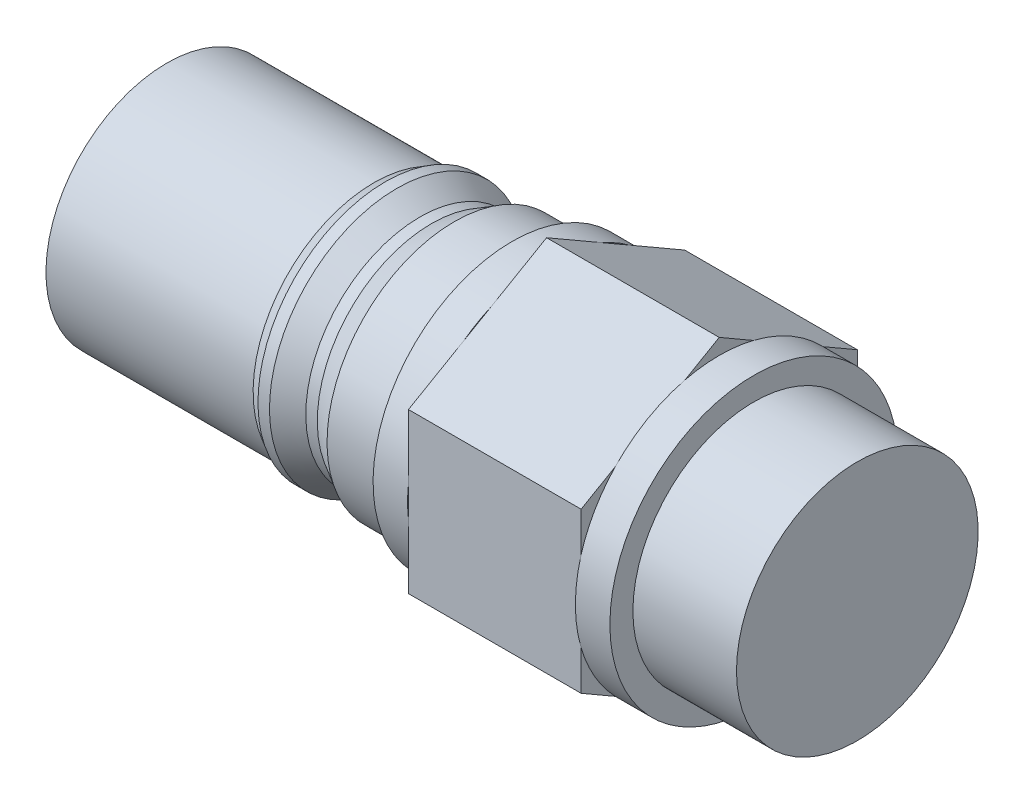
ISO-10303-21;
HEADER;
FILE_DESCRIPTION(('STEP AP214'),'2;1');
FILE_NAME('part.step','',(''),(''),'','','');
FILE_SCHEMA(('AUTOMOTIVE_DESIGN { 1 0 10303 214 1 1 1 1 }'));
ENDSEC;
DATA;
#1=APPLICATION_CONTEXT('core data for automotive mechanical design processes');
#2=APPLICATION_PROTOCOL_DEFINITION('international standard','automotive_design',2000,#1);
#3=PRODUCT_CONTEXT('',#1,'mechanical');
#4=PRODUCT('Part','Part','',(#3));
#5=PRODUCT_RELATED_PRODUCT_CATEGORY('part','',(#4));
#6=PRODUCT_DEFINITION_FORMATION('','',#4);
#7=PRODUCT_DEFINITION_CONTEXT('part definition',#1,'design');
#8=PRODUCT_DEFINITION('design','',#6,#7);
#9=PRODUCT_DEFINITION_SHAPE('','',#8);
#10=(LENGTH_UNIT() NAMED_UNIT(*) SI_UNIT(.MILLI.,.METRE.));
#11=(NAMED_UNIT(*) PLANE_ANGLE_UNIT() SI_UNIT($,.RADIAN.));
#12=(NAMED_UNIT(*) SI_UNIT($,.STERADIAN.) SOLID_ANGLE_UNIT());
#13=UNCERTAINTY_MEASURE_WITH_UNIT(LENGTH_MEASURE(1.E-05),#10,'distance_accuracy_value','');
#14=(GEOMETRIC_REPRESENTATION_CONTEXT(3) GLOBAL_UNCERTAINTY_ASSIGNED_CONTEXT((#13)) GLOBAL_UNIT_ASSIGNED_CONTEXT((#10,
#11,#12)) REPRESENTATION_CONTEXT('',''));
#15=CARTESIAN_POINT('',(0.,0.,0.));
#16=DIRECTION('',(0.,0.,1.));
#17=DIRECTION('',(1.,0.,0.));
#18=AXIS2_PLACEMENT_3D('',#15,#16,#17);
#19=CARTESIAN_POINT('',(48.,0.,0.));
#20=DIRECTION('',(1.,0.,0.));
#21=DIRECTION('',(0.,0.,-1.));
#22=AXIS2_PLACEMENT_3D('',#19,#20,#21);
#23=PLANE('',#22);
#24=DIRECTION('',(0.,-1.,0.));
#25=VECTOR('',#24,1.);
#26=CARTESIAN_POINT('',(48.,6.92820323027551,12.));
#27=LINE('',#26,#25);
#28=CARTESIAN_POINT('',(48.,6.92820323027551,12.));
#29=VERTEX_POINT('',#28);
#30=CARTESIAN_POINT('',(48.,3.5,12.));
#31=VERTEX_POINT('',#30);
#32=EDGE_CURVE('E183',#29,#31,#27,.T.);
#33=ORIENTED_EDGE('',*,*,#32,.T.);
#34=CARTESIAN_POINT('',(48.,0.,0.));
#35=DIRECTION('',(-1.,0.,0.));
#36=DIRECTION('',(0.,0.,1.));
#37=AXIS2_PLACEMENT_3D('',#34,#35,#36);
#38=CIRCLE('',#37,12.5);
#39=CARTESIAN_POINT('',(48.,8.64230484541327,9.03108891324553));
#40=VERTEX_POINT('',#39);
#41=EDGE_CURVE('E166',#31,#40,#38,.T.);
#42=ORIENTED_EDGE('',*,*,#41,.T.);
#43=DIRECTION('',(0.,-0.5,0.866025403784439));
#44=VECTOR('',#43,1.);
#45=CARTESIAN_POINT('',(48.,13.856406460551,0.));
#46=LINE('',#45,#44);
#47=EDGE_CURVE('E187',#40,#29,#46,.T.);
#48=ORIENTED_EDGE('',*,*,#47,.T.);
#49=EDGE_LOOP('',(#33,#42,#48));
#50=FACE_BOUND('',#49,.T.);
#51=ADVANCED_FACE('F33',(#50),#23,.T.);
#52=CARTESIAN_POINT('',(48.,13.856406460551,0.));
#53=VERTEX_POINT('',#52);
#54=CARTESIAN_POINT('',(48.,12.1423048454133,2.96891108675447));
#55=VERTEX_POINT('',#54);
#56=EDGE_CURVE('E194',#53,#55,#46,.T.);
#57=ORIENTED_EDGE('',*,*,#56,.T.);
#58=CARTESIAN_POINT('',(48.,12.1423048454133,-2.96891108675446));
#59=VERTEX_POINT('',#58);
#60=EDGE_CURVE('E11',#55,#59,#38,.T.);
#61=ORIENTED_EDGE('',*,*,#60,.T.);
#62=DIRECTION('',(0.,0.5,0.866025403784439));
#63=VECTOR('',#62,1.);
#64=CARTESIAN_POINT('',(48.,6.92820323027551,-12.));
#65=LINE('',#64,#63);
#66=EDGE_CURVE('E205',#59,#53,#65,.T.);
#67=ORIENTED_EDGE('',*,*,#66,.T.);
#68=EDGE_LOOP('',(#57,#61,#67));
#69=FACE_BOUND('',#68,.T.);
#70=ADVANCED_FACE('F417',(#69),#23,.T.);
#71=CARTESIAN_POINT('',(48.,6.92820323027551,-12.));
#72=VERTEX_POINT('',#71);
#73=CARTESIAN_POINT('',(48.,8.64230484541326,-9.03108891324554));
#74=VERTEX_POINT('',#73);
#75=EDGE_CURVE('E202',#72,#74,#65,.T.);
#76=ORIENTED_EDGE('',*,*,#75,.T.);
#77=CARTESIAN_POINT('',(48.,3.50000000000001,-12.));
#78=VERTEX_POINT('',#77);
#79=EDGE_CURVE('E42',#74,#78,#38,.T.);
#80=ORIENTED_EDGE('',*,*,#79,.T.);
#81=DIRECTION('',(0.,1.,0.));
#82=VECTOR('',#81,1.);
#83=CARTESIAN_POINT('',(48.,-6.92820323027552,-12.));
#84=LINE('',#83,#82);
#85=EDGE_CURVE('E260',#78,#72,#84,.T.);
#86=ORIENTED_EDGE('',*,*,#85,.T.);
#87=EDGE_LOOP('',(#76,#80,#86));
#88=FACE_BOUND('',#87,.T.);
#89=ADVANCED_FACE('F423',(#88),#23,.T.);
#90=CARTESIAN_POINT('',(48.,-6.92820323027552,-12.));
#91=VERTEX_POINT('',#90);
#92=CARTESIAN_POINT('',(48.,-3.50000000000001,-12.));
#93=VERTEX_POINT('',#92);
#94=EDGE_CURVE('E255',#91,#93,#84,.T.);
#95=ORIENTED_EDGE('',*,*,#94,.T.);
#96=CARTESIAN_POINT('',(48.,-8.64230484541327,-9.03108891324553));
#97=VERTEX_POINT('',#96);
#98=EDGE_CURVE('E281',#93,#97,#38,.T.);
#99=ORIENTED_EDGE('',*,*,#98,.T.);
#100=DIRECTION('',(0.,0.5,-0.866025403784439));
#101=VECTOR('',#100,1.);
#102=CARTESIAN_POINT('',(48.,-13.856406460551,0.));
#103=LINE('',#102,#101);
#104=EDGE_CURVE('E264',#97,#91,#103,.T.);
#105=ORIENTED_EDGE('',*,*,#104,.T.);
#106=EDGE_LOOP('',(#95,#99,#105));
#107=FACE_BOUND('',#106,.T.);
#108=ADVANCED_FACE('F300',(#107),#23,.T.);
#109=CARTESIAN_POINT('',(48.,-13.856406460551,0.));
#110=VERTEX_POINT('',#109);
#111=CARTESIAN_POINT('',(48.,-12.1423048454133,-2.96891108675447));
#112=VERTEX_POINT('',#111);
#113=EDGE_CURVE('E261',#110,#112,#103,.T.);
#114=ORIENTED_EDGE('',*,*,#113,.T.);
#115=CARTESIAN_POINT('',(48.,-12.1423048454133,2.96891108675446));
#116=VERTEX_POINT('',#115);
#117=EDGE_CURVE('E274',#112,#116,#38,.T.);
#118=ORIENTED_EDGE('',*,*,#117,.T.);
#119=DIRECTION('',(0.,-0.5,-0.866025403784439));
#120=VECTOR('',#119,1.);
#121=CARTESIAN_POINT('',(48.,-6.92820323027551,12.));
#122=LINE('',#121,#120);
#123=EDGE_CURVE('E189',#116,#110,#122,.T.);
#124=ORIENTED_EDGE('',*,*,#123,.T.);
#125=EDGE_LOOP('',(#114,#118,#124));
#126=FACE_BOUND('',#125,.T.);
#127=ADVANCED_FACE('F278',(#126),#23,.T.);
#128=CARTESIAN_POINT('',(33.,12.0773502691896,0.));
#129=DIRECTION('',(1.,0.,0.));
#130=DIRECTION('',(0.,1.,0.));
#131=AXIS2_PLACEMENT_3D('',#128,#129,#130);
#132=PLANE('',#131);
#133=DIRECTION('',(0.,0.5,0.866025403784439));
#134=VECTOR('',#133,1.);
#135=CARTESIAN_POINT('',(33.,6.92820323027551,-12.));
#136=LINE('',#135,#134);
#137=CARTESIAN_POINT('',(33.,9.70995788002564,-7.18185961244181));
#138=VERTEX_POINT('',#137);
#139=CARTESIAN_POINT('',(33.,11.0746518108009,-4.81814038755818));
#140=VERTEX_POINT('',#139);
#141=EDGE_CURVE('E223',#138,#140,#136,.T.);
#142=ORIENTED_EDGE('',*,*,#141,.F.);
#143=CARTESIAN_POINT('',(33.,0.,0.));
#144=DIRECTION('',(1.,0.,0.));
#145=DIRECTION('',(0.,1.,0.));
#146=AXIS2_PLACEMENT_3D('',#143,#144,#145);
#147=CIRCLE('',#146,12.0773502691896);
#148=EDGE_CURVE('E326',#138,#140,#147,.T.);
#149=ORIENTED_EDGE('',*,*,#148,.T.);
#150=EDGE_LOOP('',(#142,#149));
#151=FACE_BOUND('',#150,.T.);
#152=ADVANCED_FACE('F399',(#151),#132,.T.);
#153=DIRECTION('',(0.,1.,0.));
#154=VECTOR('',#153,1.);
#155=CARTESIAN_POINT('',(33.,-6.92820323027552,-12.));
#156=LINE('',#155,#154);
#157=CARTESIAN_POINT('',(33.,-1.36469393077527,-12.));
#158=VERTEX_POINT('',#157);
#159=CARTESIAN_POINT('',(33.,1.36469393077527,-12.));
#160=VERTEX_POINT('',#159);
#161=EDGE_CURVE('E215',#158,#160,#156,.T.);
#162=ORIENTED_EDGE('',*,*,#161,.F.);
#163=EDGE_CURVE('E388',#158,#160,#147,.T.);
#164=ORIENTED_EDGE('',*,*,#163,.T.);
#165=EDGE_LOOP('',(#162,#164));
#166=FACE_BOUND('',#165,.T.);
#167=ADVANCED_FACE('F443',(#166),#132,.T.);
#168=DIRECTION('',(0.,0.5,-0.866025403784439));
#169=VECTOR('',#168,1.);
#170=CARTESIAN_POINT('',(33.,-13.856406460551,0.));
#171=LINE('',#170,#169);
#172=CARTESIAN_POINT('',(33.,-11.0746518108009,-4.81814038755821));
#173=VERTEX_POINT('',#172);
#174=CARTESIAN_POINT('',(33.,-9.70995788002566,-7.18185961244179));
#175=VERTEX_POINT('',#174);
#176=EDGE_CURVE('E224',#173,#175,#171,.T.);
#177=ORIENTED_EDGE('',*,*,#176,.F.);
#178=EDGE_CURVE('E381',#173,#175,#147,.T.);
#179=ORIENTED_EDGE('',*,*,#178,.T.);
#180=EDGE_LOOP('',(#177,#179));
#181=FACE_BOUND('',#180,.T.);
#182=ADVANCED_FACE('F536',(#181),#132,.T.);
#183=DIRECTION('',(0.,-0.5,-0.866025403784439));
#184=VECTOR('',#183,1.);
#185=CARTESIAN_POINT('',(33.,-6.92820323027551,12.));
#186=LINE('',#185,#184);
#187=CARTESIAN_POINT('',(33.,-9.70995788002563,7.18185961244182));
#188=VERTEX_POINT('',#187);
#189=CARTESIAN_POINT('',(33.,-11.0746518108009,4.81814038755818));
#190=VERTEX_POINT('',#189);
#191=EDGE_CURVE('E230',#188,#190,#186,.T.);
#192=ORIENTED_EDGE('',*,*,#191,.F.);
#193=EDGE_CURVE('E374',#188,#190,#147,.T.);
#194=ORIENTED_EDGE('',*,*,#193,.T.);
#195=EDGE_LOOP('',(#192,#194));
#196=FACE_BOUND('',#195,.T.);
#197=ADVANCED_FACE('F527',(#196),#132,.T.);
#198=DIRECTION('',(0.,-1.,0.));
#199=VECTOR('',#198,1.);
#200=CARTESIAN_POINT('',(33.,6.92820323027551,12.));
#201=LINE('',#200,#199);
#202=CARTESIAN_POINT('',(33.,1.36469393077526,12.));
#203=VERTEX_POINT('',#202);
#204=CARTESIAN_POINT('',(33.,-1.36469393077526,12.));
#205=VERTEX_POINT('',#204);
#206=EDGE_CURVE('E235',#203,#205,#201,.T.);
#207=ORIENTED_EDGE('',*,*,#206,.F.);
#208=EDGE_CURVE('E368',#203,#205,#147,.T.);
#209=ORIENTED_EDGE('',*,*,#208,.T.);
#210=EDGE_LOOP('',(#207,#209));
#211=FACE_BOUND('',#210,.T.);
#212=ADVANCED_FACE('F412',(#211),#132,.T.);
#213=CARTESIAN_POINT('',(0.,0.,0.));
#214=DIRECTION('',(-1.,0.,0.));
#215=DIRECTION('',(0.,-1.,0.));
#216=AXIS2_PLACEMENT_3D('',#213,#214,#215);
#217=PLANE('',#216);
#218=CARTESIAN_POINT('',(0.,0.,0.));
#219=DIRECTION('',(1.,0.,0.));
#220=DIRECTION('',(0.,1.,0.));
#221=AXIS2_PLACEMENT_3D('',#218,#219,#220);
#222=CIRCLE('',#221,10.5);
#223=CARTESIAN_POINT('',(0.,10.5,0.));
#224=VERTEX_POINT('',#223);
#225=EDGE_CURVE('E37',#224,#224,#222,.T.);
#226=ORIENTED_EDGE('',*,*,#225,.F.);
#227=EDGE_LOOP('',(#226));
#228=FACE_BOUND('',#227,.T.);
#229=ADVANCED_FACE('F35',(#228),#217,.T.);
#230=CARTESIAN_POINT('',(33.,0.,0.));
#231=DIRECTION('',(1.,0.,0.));
#232=DIRECTION('',(0.,1.,0.));
#233=AXIS2_PLACEMENT_3D('',#230,#231,#232);
#234=CYLINDRICAL_SURFACE('',#233,10.5);
#235=ORIENTED_EDGE('',*,*,#225,.T.);
#236=EDGE_LOOP('',(#235));
#237=FACE_BOUND('',#236,.T.);
#238=CARTESIAN_POINT('',(18.,0.,0.));
#239=DIRECTION('',(1.,0.,0.));
#240=DIRECTION('',(0.,1.,0.));
#241=AXIS2_PLACEMENT_3D('',#238,#239,#240);
#242=CIRCLE('',#241,10.5);
#243=CARTESIAN_POINT('',(18.,10.5,0.));
#244=VERTEX_POINT('',#243);
#245=EDGE_CURVE('E353',#244,#244,#242,.T.);
#246=ORIENTED_EDGE('',*,*,#245,.F.);
#247=EDGE_LOOP('',(#246));
#248=FACE_BOUND('',#247,.T.);
#249=ADVANCED_FACE('F620',(#237,#248),#234,.T.);
#250=CARTESIAN_POINT('',(19.,0.,0.));
#251=DIRECTION('',(1.,0.,0.));
#252=DIRECTION('',(0.,1.,0.));
#253=AXIS2_PLACEMENT_3D('',#250,#251,#252);
#254=CONICAL_SURFACE('',#253,11.0773502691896,0.5235987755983);
#255=ORIENTED_EDGE('',*,*,#245,.T.);
#256=EDGE_LOOP('',(#255));
#257=FACE_BOUND('',#256,.T.);
#258=CARTESIAN_POINT('',(19.,0.,0.));
#259=DIRECTION('',(1.,0.,0.));
#260=DIRECTION('',(0.,1.,0.));
#261=AXIS2_PLACEMENT_3D('',#258,#259,#260);
#262=CIRCLE('',#261,11.0773502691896);
#263=CARTESIAN_POINT('',(19.,11.0773502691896,0.));
#264=VERTEX_POINT('',#263);
#265=EDGE_CURVE('E351',#264,#264,#262,.T.);
#266=ORIENTED_EDGE('',*,*,#265,.F.);
#267=EDGE_LOOP('',(#266));
#268=FACE_BOUND('',#267,.T.);
#269=ADVANCED_FACE('F610',(#257,#268),#254,.T.);
#270=CARTESIAN_POINT('',(33.,0.,0.));
#271=DIRECTION('',(1.,0.,0.));
#272=DIRECTION('',(0.,1.,0.));
#273=AXIS2_PLACEMENT_3D('',#270,#271,#272);
#274=CYLINDRICAL_SURFACE('',#273,11.0773502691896);
#275=ORIENTED_EDGE('',*,*,#265,.T.);
#276=EDGE_LOOP('',(#275));
#277=FACE_BOUND('',#276,.T.);
#278=CARTESIAN_POINT('',(20.,0.,0.));
#279=DIRECTION('',(1.,0.,0.));
#280=DIRECTION('',(0.,1.,0.));
#281=AXIS2_PLACEMENT_3D('',#278,#279,#280);
#282=CIRCLE('',#281,11.0773502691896);
#283=CARTESIAN_POINT('',(20.,11.0773502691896,0.));
#284=VERTEX_POINT('',#283);
#285=EDGE_CURVE('E348',#284,#284,#282,.T.);
#286=ORIENTED_EDGE('',*,*,#285,.F.);
#287=EDGE_LOOP('',(#286));
#288=FACE_BOUND('',#287,.T.);
#289=ADVANCED_FACE('F599',(#277,#288),#274,.T.);
#290=CARTESIAN_POINT('',(22.,0.,0.));
#291=DIRECTION('',(-1.,0.,0.));
#292=DIRECTION('',(0.,-1.,0.));
#293=AXIS2_PLACEMENT_3D('',#290,#291,#292);
#294=CONICAL_SURFACE('',#293,9.92264973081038,0.523598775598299);
#295=ORIENTED_EDGE('',*,*,#285,.T.);
#296=EDGE_LOOP('',(#295));
#297=FACE_BOUND('',#296,.T.);
#298=CARTESIAN_POINT('',(22.,0.,0.));
#299=DIRECTION('',(1.,0.,0.));
#300=DIRECTION('',(0.,1.,0.));
#301=AXIS2_PLACEMENT_3D('',#298,#299,#300);
#302=CIRCLE('',#301,9.92264973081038);
#303=CARTESIAN_POINT('',(22.,9.92264973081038,0.));
#304=VERTEX_POINT('',#303);
#305=EDGE_CURVE('E345',#304,#304,#302,.T.);
#306=ORIENTED_EDGE('',*,*,#305,.F.);
#307=EDGE_LOOP('',(#306));
#308=FACE_BOUND('',#307,.T.);
#309=ADVANCED_FACE('F589',(#297,#308),#294,.T.);
#310=CARTESIAN_POINT('',(33.,0.,0.));
#311=DIRECTION('',(1.,0.,0.));
#312=DIRECTION('',(0.,1.,0.));
#313=AXIS2_PLACEMENT_3D('',#310,#311,#312);
#314=CYLINDRICAL_SURFACE('',#313,9.92264973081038);
#315=ORIENTED_EDGE('',*,*,#305,.T.);
#316=EDGE_LOOP('',(#315));
#317=FACE_BOUND('',#316,.T.);
#318=CARTESIAN_POINT('',(23.,0.,0.));
#319=DIRECTION('',(1.,0.,0.));
#320=DIRECTION('',(0.,1.,0.));
#321=AXIS2_PLACEMENT_3D('',#318,#319,#320);
#322=CIRCLE('',#321,9.92264973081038);
#323=CARTESIAN_POINT('',(23.,9.92264973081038,0.));
#324=VERTEX_POINT('',#323);
#325=EDGE_CURVE('E342',#324,#324,#322,.T.);
#326=ORIENTED_EDGE('',*,*,#325,.F.);
#327=EDGE_LOOP('',(#326));
#328=FACE_BOUND('',#327,.T.);
#329=ADVANCED_FACE('F578',(#317,#328),#314,.T.);
#330=CARTESIAN_POINT('',(25.,0.,0.));
#331=DIRECTION('',(1.,0.,0.));
#332=DIRECTION('',(0.,1.,0.));
#333=AXIS2_PLACEMENT_3D('',#330,#331,#332);
#334=CONICAL_SURFACE('',#333,11.0773502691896,0.5235987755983);
#335=ORIENTED_EDGE('',*,*,#325,.T.);
#336=EDGE_LOOP('',(#335));
#337=FACE_BOUND('',#336,.T.);
#338=CARTESIAN_POINT('',(25.,0.,0.));
#339=DIRECTION('',(1.,0.,0.));
#340=DIRECTION('',(0.,1.,0.));
#341=AXIS2_PLACEMENT_3D('',#338,#339,#340);
#342=CIRCLE('',#341,11.0773502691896);
#343=CARTESIAN_POINT('',(25.,11.0773502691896,0.));
#344=VERTEX_POINT('',#343);
#345=EDGE_CURVE('E339',#344,#344,#342,.T.);
#346=ORIENTED_EDGE('',*,*,#345,.F.);
#347=EDGE_LOOP('',(#346));
#348=FACE_BOUND('',#347,.T.);
#349=ADVANCED_FACE('F568',(#337,#348),#334,.T.);
#350=CARTESIAN_POINT('',(33.,0.,0.));
#351=DIRECTION('',(1.,0.,0.));
#352=DIRECTION('',(0.,1.,0.));
#353=AXIS2_PLACEMENT_3D('',#350,#351,#352);
#354=CYLINDRICAL_SURFACE('',#353,11.0773502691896);
#355=ORIENTED_EDGE('',*,*,#345,.T.);
#356=EDGE_LOOP('',(#355));
#357=FACE_BOUND('',#356,.T.);
#358=CARTESIAN_POINT('',(30.,0.,0.));
#359=DIRECTION('',(1.,0.,0.));
#360=DIRECTION('',(0.,1.,0.));
#361=AXIS2_PLACEMENT_3D('',#358,#359,#360);
#362=CIRCLE('',#361,11.0773502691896);
#363=CARTESIAN_POINT('',(30.,11.0773502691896,0.));
#364=VERTEX_POINT('',#363);
#365=EDGE_CURVE('E336',#364,#364,#362,.T.);
#366=ORIENTED_EDGE('',*,*,#365,.F.);
#367=EDGE_LOOP('',(#366));
#368=FACE_BOUND('',#367,.T.);
#369=ADVANCED_FACE('F413',(#357,#368),#354,.T.);
#370=CARTESIAN_POINT('',(30.,11.0773502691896,0.));
#371=DIRECTION('',(-1.,0.,0.));
#372=DIRECTION('',(0.,-1.,0.));
#373=AXIS2_PLACEMENT_3D('',#370,#371,#372);
#374=PLANE('',#373);
#375=ORIENTED_EDGE('',*,*,#365,.T.);
#376=EDGE_LOOP('',(#375));
#377=FACE_BOUND('',#376,.T.);
#378=CARTESIAN_POINT('',(30.,0.,0.));
#379=DIRECTION('',(1.,0.,0.));
#380=DIRECTION('',(0.,1.,0.));
#381=AXIS2_PLACEMENT_3D('',#378,#379,#380);
#382=CIRCLE('',#381,12.0773502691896);
#383=CARTESIAN_POINT('',(30.,12.0773502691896,0.));
#384=VERTEX_POINT('',#383);
#385=EDGE_CURVE('E332',#384,#384,#382,.T.);
#386=ORIENTED_EDGE('',*,*,#385,.F.);
#387=EDGE_LOOP('',(#386));
#388=FACE_BOUND('',#387,.T.);
#389=ADVANCED_FACE('F403',(#377,#388),#374,.T.);
#390=CARTESIAN_POINT('',(33.,0.,0.));
#391=DIRECTION('',(1.,0.,0.));
#392=DIRECTION('',(0.,1.,0.));
#393=AXIS2_PLACEMENT_3D('',#390,#391,#392);
#394=CYLINDRICAL_SURFACE('',#393,12.0773502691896);
#395=ORIENTED_EDGE('',*,*,#385,.T.);
#396=EDGE_LOOP('',(#395));
#397=FACE_BOUND('',#396,.T.);
#398=CARTESIAN_POINT('',(33.,11.0746518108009,4.8181403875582));
#399=VERTEX_POINT('',#398);
#400=CARTESIAN_POINT('',(33.,9.70995788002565,7.1818596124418));
#401=VERTEX_POINT('',#400);
#402=EDGE_CURVE('E328',#399,#401,#147,.T.);
#403=ORIENTED_EDGE('',*,*,#402,.F.);
#404=EDGE_CURVE('E59',#140,#399,#147,.T.);
#405=ORIENTED_EDGE('',*,*,#404,.F.);
#406=ORIENTED_EDGE('',*,*,#148,.F.);
#407=EDGE_CURVE('E391',#160,#138,#147,.T.);
#408=ORIENTED_EDGE('',*,*,#407,.F.);
#409=ORIENTED_EDGE('',*,*,#163,.F.);
#410=EDGE_CURVE('E384',#175,#158,#147,.T.);
#411=ORIENTED_EDGE('',*,*,#410,.F.);
#412=ORIENTED_EDGE('',*,*,#178,.F.);
#413=EDGE_CURVE('E377',#190,#173,#147,.T.);
#414=ORIENTED_EDGE('',*,*,#413,.F.);
#415=ORIENTED_EDGE('',*,*,#193,.F.);
#416=EDGE_CURVE('E370',#205,#188,#147,.T.);
#417=ORIENTED_EDGE('',*,*,#416,.F.);
#418=ORIENTED_EDGE('',*,*,#208,.F.);
#419=EDGE_CURVE('E333',#401,#203,#147,.T.);
#420=ORIENTED_EDGE('',*,*,#419,.F.);
#421=EDGE_LOOP('',(#403,#405,#406,#408,#409,#411,#412,#414,#415,#417,#418,#420));
#422=FACE_BOUND('',#421,.T.);
#423=ADVANCED_FACE('F400',(#397,#422),#394,.T.);
#424=DIRECTION('',(0.,-0.5,0.866025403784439));
#425=VECTOR('',#424,1.);
#426=CARTESIAN_POINT('',(33.,13.856406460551,0.));
#427=LINE('',#426,#425);
#428=EDGE_CURVE('E252',#399,#401,#427,.T.);
#429=ORIENTED_EDGE('',*,*,#428,.F.);
#430=ORIENTED_EDGE('',*,*,#402,.T.);
#431=EDGE_LOOP('',(#429,#430));
#432=FACE_BOUND('',#431,.T.);
#433=ADVANCED_FACE('F402',(#432),#132,.T.);
#434=CARTESIAN_POINT('',(33.,0.,0.));
#435=DIRECTION('',(1.,0.,0.));
#436=DIRECTION('',(0.,0.,-1.));
#437=AXIS2_PLACEMENT_3D('',#434,#435,#436);
#438=PLANE('',#437);
#439=CARTESIAN_POINT('',(33.,6.92820323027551,12.));
#440=VERTEX_POINT('',#439);
#441=EDGE_CURVE('E251',#401,#440,#427,.T.);
#442=ORIENTED_EDGE('',*,*,#441,.F.);
#443=ORIENTED_EDGE('',*,*,#419,.T.);
#444=EDGE_CURVE('E245',#440,#203,#201,.T.);
#445=ORIENTED_EDGE('',*,*,#444,.F.);
#446=EDGE_LOOP('',(#442,#443,#445));
#447=FACE_BOUND('',#446,.T.);
#448=ADVANCED_FACE('F365',(#447),#438,.F.);
#449=CARTESIAN_POINT('',(33.,-6.92820323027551,12.));
#450=VERTEX_POINT('',#449);
#451=EDGE_CURVE('E248',#205,#450,#201,.T.);
#452=ORIENTED_EDGE('',*,*,#451,.F.);
#453=ORIENTED_EDGE('',*,*,#416,.T.);
#454=EDGE_CURVE('E237',#450,#188,#186,.T.);
#455=ORIENTED_EDGE('',*,*,#454,.F.);
#456=EDGE_LOOP('',(#452,#453,#455));
#457=FACE_BOUND('',#456,.T.);
#458=ADVANCED_FACE('F493',(#457),#438,.F.);
#459=CARTESIAN_POINT('',(33.,-13.856406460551,0.));
#460=VERTEX_POINT('',#459);
#461=EDGE_CURVE('E238',#190,#460,#186,.T.);
#462=ORIENTED_EDGE('',*,*,#461,.F.);
#463=ORIENTED_EDGE('',*,*,#413,.T.);
#464=EDGE_CURVE('E220',#460,#173,#171,.T.);
#465=ORIENTED_EDGE('',*,*,#464,.F.);
#466=EDGE_LOOP('',(#462,#463,#465));
#467=FACE_BOUND('',#466,.T.);
#468=ADVANCED_FACE('F485',(#467),#438,.F.);
#469=CARTESIAN_POINT('',(33.,-6.92820323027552,-12.));
#470=VERTEX_POINT('',#469);
#471=EDGE_CURVE('E231',#175,#470,#171,.T.);
#472=ORIENTED_EDGE('',*,*,#471,.F.);
#473=ORIENTED_EDGE('',*,*,#410,.T.);
#474=EDGE_CURVE('E210',#470,#158,#156,.T.);
#475=ORIENTED_EDGE('',*,*,#474,.F.);
#476=EDGE_LOOP('',(#472,#473,#475));
#477=FACE_BOUND('',#476,.T.);
#478=ADVANCED_FACE('F477',(#477),#438,.F.);
#479=CARTESIAN_POINT('',(33.,6.92820323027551,-12.));
#480=VERTEX_POINT('',#479);
#481=EDGE_CURVE('E213',#160,#480,#156,.T.);
#482=ORIENTED_EDGE('',*,*,#481,.F.);
#483=ORIENTED_EDGE('',*,*,#407,.T.);
#484=EDGE_CURVE('E227',#480,#138,#136,.T.);
#485=ORIENTED_EDGE('',*,*,#484,.F.);
#486=EDGE_LOOP('',(#482,#483,#485));
#487=FACE_BOUND('',#486,.T.);
#488=ADVANCED_FACE('F467',(#487),#438,.F.);
#489=CARTESIAN_POINT('',(33.,13.856406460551,0.));
#490=VERTEX_POINT('',#489);
#491=EDGE_CURVE('E228',#140,#490,#136,.T.);
#492=ORIENTED_EDGE('',*,*,#491,.F.);
#493=ORIENTED_EDGE('',*,*,#404,.T.);
#494=EDGE_CURVE('E249',#490,#399,#427,.T.);
#495=ORIENTED_EDGE('',*,*,#494,.F.);
#496=EDGE_LOOP('',(#492,#493,#495));
#497=FACE_BOUND('',#496,.T.);
#498=ADVANCED_FACE('F319',(#497),#438,.F.);
#499=CARTESIAN_POINT('',(48.,6.92820323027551,-12.));
#500=DIRECTION('',(0.,-0.866025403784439,0.5));
#501=DIRECTION('',(0.,-0.5,-0.866025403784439));
#502=AXIS2_PLACEMENT_3D('',#499,#500,#501);
#503=PLANE('',#502);
#504=ORIENTED_EDGE('',*,*,#484,.T.);
#505=ORIENTED_EDGE('',*,*,#141,.T.);
#506=ORIENTED_EDGE('',*,*,#491,.T.);
#507=DIRECTION('',(-1.,0.,0.));
#508=VECTOR('',#507,1.);
#509=CARTESIAN_POINT('',(48.,13.856406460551,0.));
#510=LINE('',#509,#508);
#511=EDGE_CURVE('E317',#53,#490,#510,.T.);
#512=ORIENTED_EDGE('',*,*,#511,.F.);
#513=ORIENTED_EDGE('',*,*,#66,.F.);
#514=EDGE_CURVE('E204',#74,#59,#65,.T.);
#515=ORIENTED_EDGE('',*,*,#514,.F.);
#516=ORIENTED_EDGE('',*,*,#75,.F.);
#517=DIRECTION('',(-1.,0.,0.));
#518=VECTOR('',#517,1.);
#519=CARTESIAN_POINT('',(48.,6.92820323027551,-12.));
#520=LINE('',#519,#518);
#521=EDGE_CURVE('E258',#72,#480,#520,.T.);
#522=ORIENTED_EDGE('',*,*,#521,.T.);
#523=EDGE_LOOP('',(#504,#505,#506,#512,#513,#515,#516,#522));
#524=FACE_BOUND('',#523,.T.);
#525=ADVANCED_FACE('F315',(#524),#503,.F.);
#526=CARTESIAN_POINT('',(48.,13.856406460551,0.));
#527=DIRECTION('',(0.,-0.866025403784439,-0.5));
#528=DIRECTION('',(0.,0.5,-0.866025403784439));
#529=AXIS2_PLACEMENT_3D('',#526,#527,#528);
#530=PLANE('',#529);
#531=ORIENTED_EDGE('',*,*,#494,.T.);
#532=ORIENTED_EDGE('',*,*,#428,.T.);
#533=ORIENTED_EDGE('',*,*,#441,.T.);
#534=DIRECTION('',(-1.,0.,0.));
#535=VECTOR('',#534,1.);
#536=CARTESIAN_POINT('',(48.,6.92820323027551,12.));
#537=LINE('',#536,#535);
#538=EDGE_CURVE('E324',#29,#440,#537,.T.);
#539=ORIENTED_EDGE('',*,*,#538,.F.);
#540=ORIENTED_EDGE('',*,*,#47,.F.);
#541=EDGE_CURVE('E198',#55,#40,#46,.T.);
#542=ORIENTED_EDGE('',*,*,#541,.F.);
#543=ORIENTED_EDGE('',*,*,#56,.F.);
#544=ORIENTED_EDGE('',*,*,#511,.T.);
#545=EDGE_LOOP('',(#531,#532,#533,#539,#540,#542,#543,#544));
#546=FACE_BOUND('',#545,.T.);
#547=ADVANCED_FACE('F322',(#546),#530,.F.);
#548=CARTESIAN_POINT('',(48.,6.92820323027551,12.));
#549=DIRECTION('',(0.,0.,-1.));
#550=DIRECTION('',(-1.,0.,0.));
#551=AXIS2_PLACEMENT_3D('',#548,#549,#550);
#552=PLANE('',#551);
#553=ORIENTED_EDGE('',*,*,#444,.T.);
#554=ORIENTED_EDGE('',*,*,#206,.T.);
#555=ORIENTED_EDGE('',*,*,#451,.T.);
#556=DIRECTION('',(-1.,0.,0.));
#557=VECTOR('',#556,1.);
#558=CARTESIAN_POINT('',(48.,-6.92820323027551,12.));
#559=LINE('',#558,#557);
#560=CARTESIAN_POINT('',(48.,-6.92820323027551,12.));
#561=VERTEX_POINT('',#560);
#562=EDGE_CURVE('E287',#561,#450,#559,.T.);
#563=ORIENTED_EDGE('',*,*,#562,.F.);
#564=CARTESIAN_POINT('',(48.,-3.5,12.));
#565=VERTEX_POINT('',#564);
#566=EDGE_CURVE('E185',#565,#561,#27,.T.);
#567=ORIENTED_EDGE('',*,*,#566,.F.);
#568=EDGE_CURVE('E163',#31,#565,#27,.T.);
#569=ORIENTED_EDGE('',*,*,#568,.F.);
#570=ORIENTED_EDGE('',*,*,#32,.F.);
#571=ORIENTED_EDGE('',*,*,#538,.T.);
#572=EDGE_LOOP('',(#553,#554,#555,#563,#567,#569,#570,#571));
#573=FACE_BOUND('',#572,.T.);
#574=ADVANCED_FACE('F181',(#573),#552,.F.);
#575=CARTESIAN_POINT('',(48.,-6.92820323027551,12.));
#576=DIRECTION('',(0.,0.866025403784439,-0.5));
#577=DIRECTION('',(0.,0.5,0.866025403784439));
#578=AXIS2_PLACEMENT_3D('',#575,#576,#577);
#579=PLANE('',#578);
#580=ORIENTED_EDGE('',*,*,#454,.T.);
#581=ORIENTED_EDGE('',*,*,#191,.T.);
#582=ORIENTED_EDGE('',*,*,#461,.T.);
#583=DIRECTION('',(-1.,0.,0.));
#584=VECTOR('',#583,1.);
#585=CARTESIAN_POINT('',(48.,-13.856406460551,0.));
#586=LINE('',#585,#584);
#587=EDGE_CURVE('E284',#110,#460,#586,.T.);
#588=ORIENTED_EDGE('',*,*,#587,.F.);
#589=ORIENTED_EDGE('',*,*,#123,.F.);
#590=CARTESIAN_POINT('',(48.,-8.64230484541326,9.03108891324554));
#591=VERTEX_POINT('',#590);
#592=EDGE_CURVE('E190',#591,#116,#122,.T.);
#593=ORIENTED_EDGE('',*,*,#592,.F.);
#594=EDGE_CURVE('E192',#561,#591,#122,.T.);
#595=ORIENTED_EDGE('',*,*,#594,.F.);
#596=ORIENTED_EDGE('',*,*,#562,.T.);
#597=EDGE_LOOP('',(#580,#581,#582,#588,#589,#593,#595,#596));
#598=FACE_BOUND('',#597,.T.);
#599=ADVANCED_FACE('F282',(#598),#579,.F.);
#600=CARTESIAN_POINT('',(48.,-13.856406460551,0.));
#601=DIRECTION('',(0.,0.866025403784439,0.5));
#602=DIRECTION('',(0.,-0.5,0.866025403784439));
#603=AXIS2_PLACEMENT_3D('',#600,#601,#602);
#604=PLANE('',#603);
#605=ORIENTED_EDGE('',*,*,#464,.T.);
#606=ORIENTED_EDGE('',*,*,#176,.T.);
#607=ORIENTED_EDGE('',*,*,#471,.T.);
#608=DIRECTION('',(-1.,0.,0.));
#609=VECTOR('',#608,1.);
#610=CARTESIAN_POINT('',(48.,-6.92820323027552,-12.));
#611=LINE('',#610,#609);
#612=EDGE_CURVE('E288',#91,#470,#611,.T.);
#613=ORIENTED_EDGE('',*,*,#612,.F.);
#614=ORIENTED_EDGE('',*,*,#104,.F.);
#615=EDGE_CURVE('E263',#112,#97,#103,.T.);
#616=ORIENTED_EDGE('',*,*,#615,.F.);
#617=ORIENTED_EDGE('',*,*,#113,.F.);
#618=ORIENTED_EDGE('',*,*,#587,.T.);
#619=EDGE_LOOP('',(#605,#606,#607,#613,#614,#616,#617,#618));
#620=FACE_BOUND('',#619,.T.);
#621=ADVANCED_FACE('F291',(#620),#604,.F.);
#622=CARTESIAN_POINT('',(48.,-6.92820323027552,-12.));
#623=DIRECTION('',(0.,0.,1.));
#624=DIRECTION('',(1.,0.,0.));
#625=AXIS2_PLACEMENT_3D('',#622,#623,#624);
#626=PLANE('',#625);
#627=ORIENTED_EDGE('',*,*,#474,.T.);
#628=ORIENTED_EDGE('',*,*,#161,.T.);
#629=ORIENTED_EDGE('',*,*,#481,.T.);
#630=ORIENTED_EDGE('',*,*,#521,.F.);
#631=ORIENTED_EDGE('',*,*,#85,.F.);
#632=EDGE_CURVE('E259',#93,#78,#84,.T.);
#633=ORIENTED_EDGE('',*,*,#632,.F.);
#634=ORIENTED_EDGE('',*,*,#94,.F.);
#635=ORIENTED_EDGE('',*,*,#612,.T.);
#636=EDGE_LOOP('',(#627,#628,#629,#630,#631,#633,#634,#635));
#637=FACE_BOUND('',#636,.T.);
#638=ADVANCED_FACE('F428',(#637),#626,.F.);
#639=ORIENTED_EDGE('',*,*,#594,.T.);
#640=EDGE_CURVE('E176',#591,#565,#38,.T.);
#641=ORIENTED_EDGE('',*,*,#640,.T.);
#642=ORIENTED_EDGE('',*,*,#566,.T.);
#643=EDGE_LOOP('',(#639,#641,#642));
#644=FACE_BOUND('',#643,.T.);
#645=ADVANCED_FACE('F419',(#644),#23,.T.);
#646=CARTESIAN_POINT('',(48.,12.5,0.));
#647=DIRECTION('',(1.,0.,0.));
#648=DIRECTION('',(0.,0.,-1.));
#649=AXIS2_PLACEMENT_3D('',#646,#647,#648);
#650=PLANE('',#649);
#651=EDGE_CURVE('E766',#59,#74,#38,.T.);
#652=ORIENTED_EDGE('',*,*,#651,.T.);
#653=ORIENTED_EDGE('',*,*,#514,.T.);
#654=EDGE_LOOP('',(#652,#653));
#655=FACE_BOUND('',#654,.T.);
#656=ADVANCED_FACE('F427',(#655),#650,.F.);
#657=EDGE_CURVE('E44',#40,#55,#38,.T.);
#658=ORIENTED_EDGE('',*,*,#657,.T.);
#659=ORIENTED_EDGE('',*,*,#541,.T.);
#660=EDGE_LOOP('',(#658,#659));
#661=FACE_BOUND('',#660,.T.);
#662=ADVANCED_FACE('F433',(#661),#650,.F.);
#663=EDGE_CURVE('E51',#565,#31,#38,.T.);
#664=ORIENTED_EDGE('',*,*,#663,.T.);
#665=ORIENTED_EDGE('',*,*,#568,.T.);
#666=EDGE_LOOP('',(#664,#665));
#667=FACE_BOUND('',#666,.T.);
#668=ADVANCED_FACE('F161',(#667),#650,.F.);
#669=EDGE_CURVE('E165',#116,#591,#38,.T.);
#670=ORIENTED_EDGE('',*,*,#669,.T.);
#671=ORIENTED_EDGE('',*,*,#592,.T.);
#672=EDGE_LOOP('',(#670,#671));
#673=FACE_BOUND('',#672,.T.);
#674=ADVANCED_FACE('F270',(#673),#650,.F.);
#675=EDGE_CURVE('E276',#97,#112,#38,.T.);
#676=ORIENTED_EDGE('',*,*,#675,.T.);
#677=ORIENTED_EDGE('',*,*,#615,.T.);
#678=EDGE_LOOP('',(#676,#677));
#679=FACE_BOUND('',#678,.T.);
#680=ADVANCED_FACE('F294',(#679),#650,.F.);
#681=EDGE_CURVE('E298',#78,#93,#38,.T.);
#682=ORIENTED_EDGE('',*,*,#681,.T.);
#683=ORIENTED_EDGE('',*,*,#632,.T.);
#684=EDGE_LOOP('',(#682,#683));
#685=FACE_BOUND('',#684,.T.);
#686=ADVANCED_FACE('F436',(#685),#650,.F.);
#687=CARTESIAN_POINT('',(60.,0.,0.));
#688=DIRECTION('',(-1.,0.,0.));
#689=DIRECTION('',(0.,0.,1.));
#690=AXIS2_PLACEMENT_3D('',#687,#688,#689);
#691=PLANE('',#690);
#692=CARTESIAN_POINT('',(60.,0.,0.));
#693=DIRECTION('',(-1.,0.,0.));
#694=DIRECTION('',(0.,0.,1.));
#695=AXIS2_PLACEMENT_3D('',#692,#693,#694);
#696=CIRCLE('',#695,10.5);
#697=CARTESIAN_POINT('',(60.,0.,10.5));
#698=VERTEX_POINT('',#697);
#699=EDGE_CURVE('E307',#698,#698,#696,.T.);
#700=ORIENTED_EDGE('',*,*,#699,.F.);
#701=EDGE_LOOP('',(#700));
#702=FACE_BOUND('',#701,.T.);
#703=ADVANCED_FACE('F722',(#702),#691,.F.);
#704=CARTESIAN_POINT('',(48.,0.,0.));
#705=DIRECTION('',(-1.,0.,0.));
#706=DIRECTION('',(0.,0.,1.));
#707=AXIS2_PLACEMENT_3D('',#704,#705,#706);
#708=CYLINDRICAL_SURFACE('',#707,10.5);
#709=CARTESIAN_POINT('',(51.,0.,0.));
#710=DIRECTION('',(-1.,0.,0.));
#711=DIRECTION('',(0.,0.,1.));
#712=AXIS2_PLACEMENT_3D('',#709,#710,#711);
#713=CIRCLE('',#712,10.5);
#714=CARTESIAN_POINT('',(51.,0.,10.5));
#715=VERTEX_POINT('',#714);
#716=EDGE_CURVE('E305',#715,#715,#713,.T.);
#717=ORIENTED_EDGE('',*,*,#716,.F.);
#718=EDGE_LOOP('',(#717));
#719=FACE_BOUND('',#718,.T.);
#720=ORIENTED_EDGE('',*,*,#699,.T.);
#721=EDGE_LOOP('',(#720));
#722=FACE_BOUND('',#721,.T.);
#723=ADVANCED_FACE('F731',(#719,#722),#708,.T.);
#724=CARTESIAN_POINT('',(51.,10.5,0.));
#725=DIRECTION('',(-1.,0.,0.));
#726=DIRECTION('',(0.,0.,1.));
#727=AXIS2_PLACEMENT_3D('',#724,#725,#726);
#728=PLANE('',#727);
#729=CARTESIAN_POINT('',(51.,0.,0.));
#730=DIRECTION('',(-1.,0.,0.));
#731=DIRECTION('',(0.,0.,1.));
#732=AXIS2_PLACEMENT_3D('',#729,#730,#731);
#733=CIRCLE('',#732,12.5);
#734=CARTESIAN_POINT('',(51.,0.,12.5));
#735=VERTEX_POINT('',#734);
#736=EDGE_CURVE('E175',#735,#735,#733,.T.);
#737=ORIENTED_EDGE('',*,*,#736,.F.);
#738=EDGE_LOOP('',(#737));
#739=FACE_BOUND('',#738,.T.);
#740=ORIENTED_EDGE('',*,*,#716,.T.);
#741=EDGE_LOOP('',(#740));
#742=FACE_BOUND('',#741,.T.);
#743=ADVANCED_FACE('F740',(#739,#742),#728,.F.);
#744=CARTESIAN_POINT('',(48.,0.,0.));
#745=DIRECTION('',(-1.,0.,0.));
#746=DIRECTION('',(0.,0.,1.));
#747=AXIS2_PLACEMENT_3D('',#744,#745,#746);
#748=CYLINDRICAL_SURFACE('',#747,12.5);
#749=ORIENTED_EDGE('',*,*,#41,.F.);
#750=ORIENTED_EDGE('',*,*,#663,.F.);
#751=ORIENTED_EDGE('',*,*,#640,.F.);
#752=ORIENTED_EDGE('',*,*,#669,.F.);
#753=ORIENTED_EDGE('',*,*,#117,.F.);
#754=ORIENTED_EDGE('',*,*,#675,.F.);
#755=ORIENTED_EDGE('',*,*,#98,.F.);
#756=ORIENTED_EDGE('',*,*,#681,.F.);
#757=ORIENTED_EDGE('',*,*,#79,.F.);
#758=ORIENTED_EDGE('',*,*,#651,.F.);
#759=ORIENTED_EDGE('',*,*,#60,.F.);
#760=ORIENTED_EDGE('',*,*,#657,.F.);
#761=EDGE_LOOP('',(#749,#750,#751,#752,#753,#754,#755,#756,#757,#758,#759,#760));
#762=FACE_BOUND('',#761,.T.);
#763=ORIENTED_EDGE('',*,*,#736,.T.);
#764=EDGE_LOOP('',(#763));
#765=FACE_BOUND('',#764,.T.);
#766=ADVANCED_FACE('F169',(#762,#765),#748,.T.);
#767=CLOSED_SHELL('',(#51,#70,#89,#108,#127,#152,#167,#182,#197,#212,#229,#249,#269,#289,#309,
#329,#349,#369,#389,#423,#433,#448,#458,#468,#478,#488,#498,#525,#547,#574,#599,#621,#638,#645,
#656,#662,#668,#674,#680,#686,#703,#723,#743,#766));
#768=MANIFOLD_SOLID_BREP('B2',#767);
#769=ADVANCED_BREP_SHAPE_REPRESENTATION('',(#18,#768),#14);
#770=SHAPE_DEFINITION_REPRESENTATION(#9,#769);
ENDSEC;
END-ISO-10303-21;
